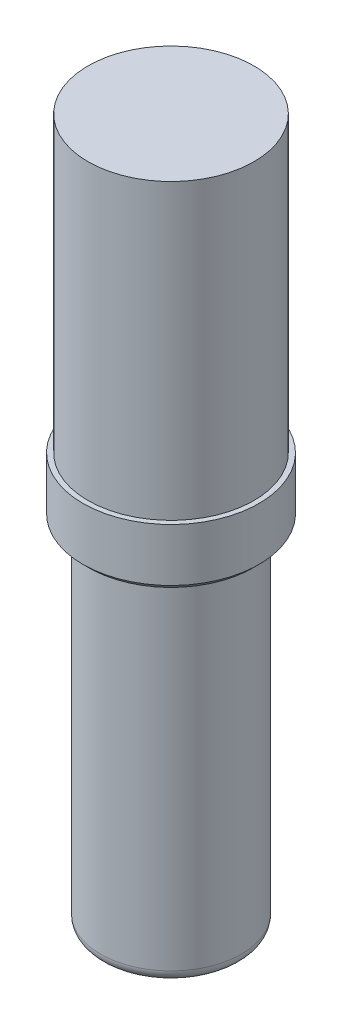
ISO-10303-21;
HEADER;
FILE_DESCRIPTION(('STEP AP214'),'2;1');
FILE_NAME('part.step','',(''),(''),'','','');
FILE_SCHEMA(('AUTOMOTIVE_DESIGN { 1 0 10303 214 1 1 1 1 }'));
ENDSEC;
DATA;
#1=APPLICATION_CONTEXT('core data for automotive mechanical design processes');
#2=APPLICATION_PROTOCOL_DEFINITION('international standard','automotive_design',2000,#1);
#3=PRODUCT_CONTEXT('',#1,'mechanical');
#4=PRODUCT('Part','Part','',(#3));
#5=PRODUCT_RELATED_PRODUCT_CATEGORY('part','',(#4));
#6=PRODUCT_DEFINITION_FORMATION('','',#4);
#7=PRODUCT_DEFINITION_CONTEXT('part definition',#1,'design');
#8=PRODUCT_DEFINITION('design','',#6,#7);
#9=PRODUCT_DEFINITION_SHAPE('','',#8);
#10=(LENGTH_UNIT() NAMED_UNIT(*) SI_UNIT(.MILLI.,.METRE.));
#11=(NAMED_UNIT(*) PLANE_ANGLE_UNIT() SI_UNIT($,.RADIAN.));
#12=(NAMED_UNIT(*) SI_UNIT($,.STERADIAN.) SOLID_ANGLE_UNIT());
#13=UNCERTAINTY_MEASURE_WITH_UNIT(LENGTH_MEASURE(1.E-05),#10,'distance_accuracy_value','');
#14=(GEOMETRIC_REPRESENTATION_CONTEXT(3) GLOBAL_UNCERTAINTY_ASSIGNED_CONTEXT((#13)) GLOBAL_UNIT_ASSIGNED_CONTEXT((#10,
#11,#12)) REPRESENTATION_CONTEXT('',''));
#15=CARTESIAN_POINT('',(0.,0.,0.));
#16=DIRECTION('',(0.,0.,1.));
#17=DIRECTION('',(1.,0.,0.));
#18=AXIS2_PLACEMENT_3D('',#15,#16,#17);
#19=CARTESIAN_POINT('',(0.,25.,0.));
#20=DIRECTION('',(0.,-1.,0.));
#21=DIRECTION('',(0.,0.,-1.));
#22=AXIS2_PLACEMENT_3D('',#19,#20,#21);
#23=CYLINDRICAL_SURFACE('',#22,7.07106781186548);
#24=CARTESIAN_POINT('',(0.,25.,0.));
#25=DIRECTION('',(0.,1.,0.));
#26=DIRECTION('',(0.,0.,1.));
#27=AXIS2_PLACEMENT_3D('',#24,#25,#26);
#28=CIRCLE('',#27,7.07106781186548);
#29=CARTESIAN_POINT('',(0.,25.,7.07106781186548));
#30=VERTEX_POINT('',#29);
#31=EDGE_CURVE('E64',#30,#30,#28,.T.);
#32=ORIENTED_EDGE('',*,*,#31,.F.);
#33=EDGE_LOOP('',(#32));
#34=FACE_BOUND('',#33,.T.);
#35=CARTESIAN_POINT('',(0.,0.,0.));
#36=DIRECTION('',(0.,1.,0.));
#37=DIRECTION('',(0.,0.,1.));
#38=AXIS2_PLACEMENT_3D('',#35,#36,#37);
#39=CIRCLE('',#38,7.07106781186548);
#40=CARTESIAN_POINT('',(0.,0.,7.07106781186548));
#41=VERTEX_POINT('',#40);
#42=EDGE_CURVE('E61',#41,#41,#39,.T.);
#43=ORIENTED_EDGE('',*,*,#42,.T.);
#44=EDGE_LOOP('',(#43));
#45=FACE_BOUND('',#44,.T.);
#46=ADVANCED_FACE('F39',(#34,#45),#23,.T.);
#47=CARTESIAN_POINT('',(0.,25.,0.));
#48=DIRECTION('',(0.,1.,0.));
#49=DIRECTION('',(0.,0.,1.));
#50=AXIS2_PLACEMENT_3D('',#47,#48,#49);
#51=PLANE('',#50);
#52=ORIENTED_EDGE('',*,*,#31,.T.);
#53=EDGE_LOOP('',(#52));
#54=FACE_BOUND('',#53,.T.);
#55=ADVANCED_FACE('F86',(#54),#51,.T.);
#56=CARTESIAN_POINT('',(0.,-5.,0.));
#57=DIRECTION('',(0.,1.,0.));
#58=DIRECTION('',(0.,0.,1.));
#59=AXIS2_PLACEMENT_3D('',#56,#57,#58);
#60=CYLINDRICAL_SURFACE('',#59,7.5);
#61=CARTESIAN_POINT('',(0.,-4.5,0.));
#62=DIRECTION('',(0.,-1.,0.));
#63=DIRECTION('',(0.,0.,-1.));
#64=AXIS2_PLACEMENT_3D('',#61,#62,#63);
#65=CIRCLE('',#64,7.5);
#66=CARTESIAN_POINT('',(0.,-4.5,-7.5));
#67=VERTEX_POINT('',#66);
#68=EDGE_CURVE('E10',#67,#67,#65,.F.);
#69=ORIENTED_EDGE('',*,*,#68,.T.);
#70=EDGE_LOOP('',(#69));
#71=FACE_BOUND('',#70,.T.);
#72=CARTESIAN_POINT('',(0.,0.,0.));
#73=DIRECTION('',(0.,-1.,0.));
#74=DIRECTION('',(0.,0.,-1.));
#75=AXIS2_PLACEMENT_3D('',#72,#73,#74);
#76=CIRCLE('',#75,7.5);
#77=CARTESIAN_POINT('',(0.,0.,-7.5));
#78=VERTEX_POINT('',#77);
#79=EDGE_CURVE('E65',#78,#78,#76,.T.);
#80=ORIENTED_EDGE('',*,*,#79,.T.);
#81=EDGE_LOOP('',(#80));
#82=FACE_BOUND('',#81,.T.);
#83=ADVANCED_FACE('F78',(#71,#82),#60,.T.);
#84=CARTESIAN_POINT('',(0.,-5.,0.));
#85=DIRECTION('',(0.,-1.,0.));
#86=DIRECTION('',(0.,0.,-1.));
#87=AXIS2_PLACEMENT_3D('',#84,#85,#86);
#88=PLANE('',#87);
#89=CARTESIAN_POINT('',(0.,-5.,0.));
#90=DIRECTION('',(0.,-1.,0.));
#91=DIRECTION('',(0.,0.,-1.));
#92=AXIS2_PLACEMENT_3D('',#89,#90,#91);
#93=CIRCLE('',#92,7.);
#94=CARTESIAN_POINT('',(0.,-5.,-7.));
#95=VERTEX_POINT('',#94);
#96=EDGE_CURVE('E47',#95,#95,#93,.T.);
#97=ORIENTED_EDGE('',*,*,#96,.T.);
#98=EDGE_LOOP('',(#97));
#99=FACE_BOUND('',#98,.T.);
#100=CARTESIAN_POINT('',(0.,-5.,0.));
#101=DIRECTION('',(0.,-1.,0.));
#102=DIRECTION('',(0.,0.,-1.));
#103=AXIS2_PLACEMENT_3D('',#100,#101,#102);
#104=CIRCLE('',#103,6.);
#105=CARTESIAN_POINT('',(0.,-5.,-6.));
#106=VERTEX_POINT('',#105);
#107=EDGE_CURVE('E60',#106,#106,#104,.T.);
#108=ORIENTED_EDGE('',*,*,#107,.F.);
#109=EDGE_LOOP('',(#108));
#110=FACE_BOUND('',#109,.T.);
#111=ADVANCED_FACE('F75',(#99,#110),#88,.T.);
#112=CARTESIAN_POINT('',(0.,0.,0.));
#113=DIRECTION('',(0.,-1.,0.));
#114=DIRECTION('',(0.,0.,-1.));
#115=AXIS2_PLACEMENT_3D('',#112,#113,#114);
#116=PLANE('',#115);
#117=ORIENTED_EDGE('',*,*,#42,.F.);
#118=EDGE_LOOP('',(#117));
#119=FACE_BOUND('',#118,.T.);
#120=ORIENTED_EDGE('',*,*,#79,.F.);
#121=EDGE_LOOP('',(#120));
#122=FACE_BOUND('',#121,.T.);
#123=ADVANCED_FACE('F77',(#119,#122),#116,.F.);
#124=CARTESIAN_POINT('',(0.,-35.,0.));
#125=DIRECTION('',(0.,1.,0.));
#126=DIRECTION('',(0.,0.,1.));
#127=AXIS2_PLACEMENT_3D('',#124,#125,#126);
#128=CYLINDRICAL_SURFACE('',#127,6.);
#129=CARTESIAN_POINT('',(0.,-34.,0.));
#130=DIRECTION('',(0.,-1.,0.));
#131=DIRECTION('',(0.,0.,-1.));
#132=AXIS2_PLACEMENT_3D('',#129,#130,#131);
#133=CIRCLE('',#132,6.);
#134=CARTESIAN_POINT('',(0.,-34.,-6.));
#135=VERTEX_POINT('',#134);
#136=EDGE_CURVE('E51',#135,#135,#133,.F.);
#137=ORIENTED_EDGE('',*,*,#136,.T.);
#138=EDGE_LOOP('',(#137));
#139=FACE_BOUND('',#138,.T.);
#140=ORIENTED_EDGE('',*,*,#107,.T.);
#141=EDGE_LOOP('',(#140));
#142=FACE_BOUND('',#141,.T.);
#143=ADVANCED_FACE('F73',(#139,#142),#128,.T.);
#144=CARTESIAN_POINT('',(0.,-35.,0.));
#145=DIRECTION('',(0.,-1.,0.));
#146=DIRECTION('',(0.,0.,-1.));
#147=AXIS2_PLACEMENT_3D('',#144,#145,#146);
#148=PLANE('',#147);
#149=CARTESIAN_POINT('',(0.,-35.,0.));
#150=DIRECTION('',(0.,-1.,0.));
#151=DIRECTION('',(0.,0.,-1.));
#152=AXIS2_PLACEMENT_3D('',#149,#150,#151);
#153=CIRCLE('',#152,5.);
#154=CARTESIAN_POINT('',(0.,-35.,-5.));
#155=VERTEX_POINT('',#154);
#156=EDGE_CURVE('E55',#155,#155,#153,.T.);
#157=ORIENTED_EDGE('',*,*,#156,.T.);
#158=EDGE_LOOP('',(#157));
#159=FACE_BOUND('',#158,.T.);
#160=ADVANCED_FACE('F101',(#159),#148,.T.);
#161=CARTESIAN_POINT('',(0.,-34.,0.));
#162=DIRECTION('',(0.,-1.,0.));
#163=DIRECTION('',(0.,0.,-1.));
#164=AXIS2_PLACEMENT_3D('',#161,#162,#163);
#165=TOROIDAL_SURFACE('',#164,5.,1.);
#166=ORIENTED_EDGE('',*,*,#136,.F.);
#167=EDGE_LOOP('',(#166));
#168=FACE_BOUND('',#167,.T.);
#169=ORIENTED_EDGE('',*,*,#156,.F.);
#170=EDGE_LOOP('',(#169));
#171=FACE_BOUND('',#170,.T.);
#172=ADVANCED_FACE('F99',(#168,#171),#165,.T.);
#173=CARTESIAN_POINT('',(0.,-5.,0.));
#174=DIRECTION('',(0.,1.,0.));
#175=DIRECTION('',(0.,0.,1.));
#176=AXIS2_PLACEMENT_3D('',#173,#174,#175);
#177=CONICAL_SURFACE('',#176,7.,0.785398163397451);
#178=ORIENTED_EDGE('',*,*,#68,.F.);
#179=EDGE_LOOP('',(#178));
#180=FACE_BOUND('',#179,.T.);
#181=ORIENTED_EDGE('',*,*,#96,.F.);
#182=EDGE_LOOP('',(#181));
#183=FACE_BOUND('',#182,.T.);
#184=ADVANCED_FACE('F42',(#180,#183),#177,.T.);
#185=CLOSED_SHELL('',(#46,#55,#83,#111,#123,#143,#160,#172,#184));
#186=MANIFOLD_SOLID_BREP('B2',#185);
#187=ADVANCED_BREP_SHAPE_REPRESENTATION('',(#18,#186),#14);
#188=SHAPE_DEFINITION_REPRESENTATION(#9,#187);
ENDSEC;
END-ISO-10303-21;
